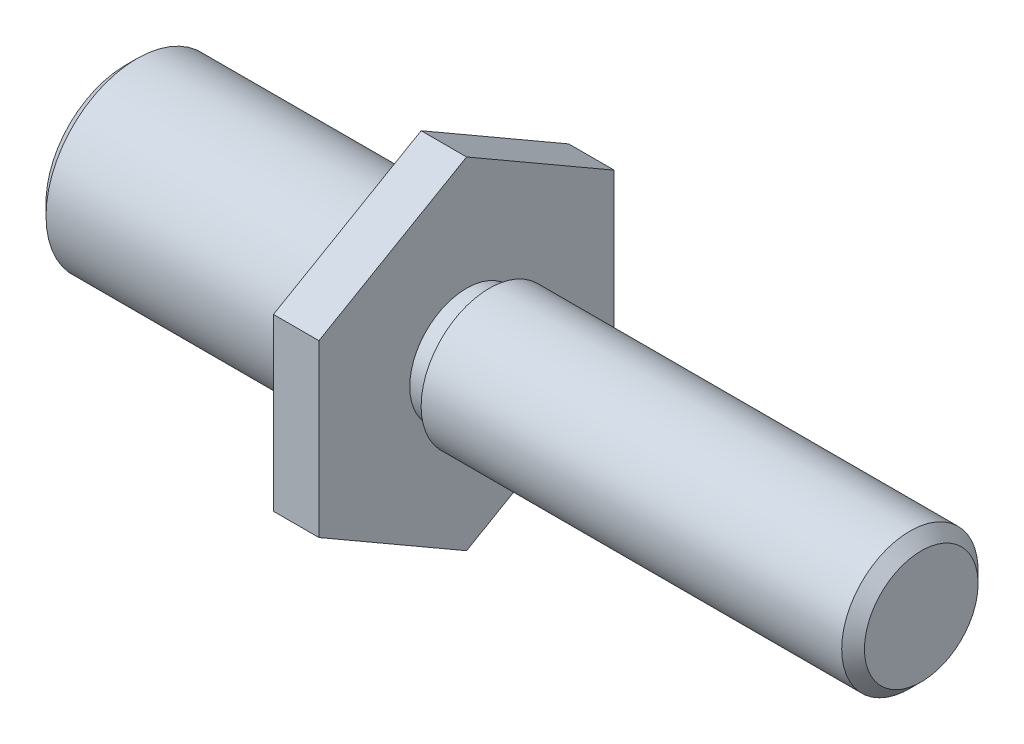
from build123d import *

# Parameters (mm, degrees)
CHANFREIN1_SIZE         = 0.5
ESQUISSE3_OUTSIDE_W     = 25.186
ESQUISSE3_OUTSIDE_H     = 25.186
ENL_V_MAT_EXTRU_2_DEPTH = 37.571847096


with BuildPart() as part:
    # Esquisse1 → Base-R_volution (revolve)
    with BuildSketch(Plane.XY, mode=Mode.PRIVATE) as base_r_volution_sk:
        Polygon((0, 0), (0, 4), (12, 4), (12, 3.5), (13, 3.5), (13, 7.5), (15, 7.5), (15, 2.5), (16, 2.5), (16, 3), (35, 3), (35, 0), align=None)
    revolve(base_r_volution_sk.sketch.rotate(Axis((0, 0, 0), (1, 0, 0)), 90), axis=Axis((0, 0, 0), (1, 0, 0)))

    # Chanfrein1
    chanfrein1_edges = [part.edges().sort_by_distance(p)[0] for p in [
        (0, 0, -4),
        (35, 0, -3),
    ]]
    chamfer(chanfrein1_edges, length=CHANFREIN1_SIZE)

    # Esquisse3 outside → Enl_v. mat.-Extru.2 (cut, through all)
    with BuildSketch(Plane(origin=(0, 0, 0), x_dir=(0, 0, -1), z_dir=(1, 0, 0))):
        Rectangle(ESQUISSE3_OUTSIDE_W, ESQUISSE3_OUTSIDE_H)
        Polygon((-6.495190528, 3.75), (-6.495190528, -3.75), (0, -7.5), (6.495190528, -3.75), (6.495190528, 3.75), (0, 7.5), align=None, mode=Mode.SUBTRACT)
    extrude(amount=ENL_V_MAT_EXTRU_2_DEPTH, mode=Mode.SUBTRACT)


solid = part.part
